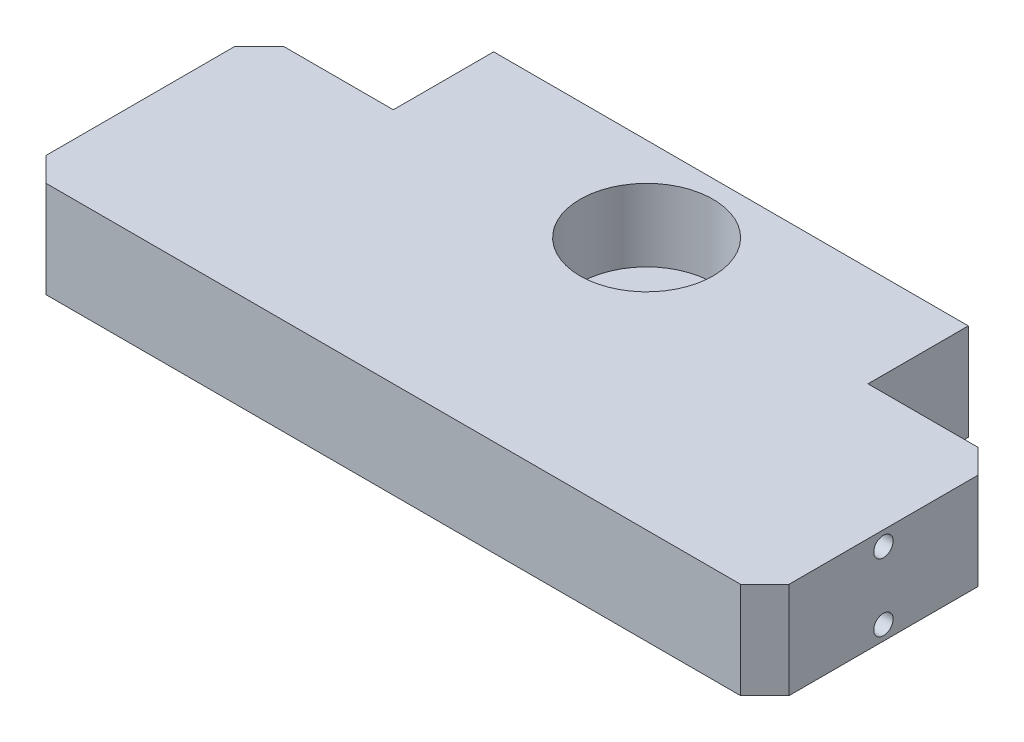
from build123d import *

# Parameters (mm, degrees)
SKETCH1_W                             = 195.58
SKETCH1_H                             = 88.9
EXTRUDE1_DEPTH                        = 25.4
SKETCH2_R                             = 17.5006
CUT_EXTRUDE1_DEPTH                    = 19.05
SKETCH3_R                             = 4.953
CUT_EXTRUDE2_DEPTH                    = 217.332860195
SKETCH4_W                             = 35.306
SKETCH4_H                             = 26.416
CUT_EXTRUDE3_DEPTH                    = 217.332860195
F_1_4_20_TAPPED_HOLE1_D               = 5.1054
F_1_4_20_TAPPED_HOLE1_DEPTH           = 19.05
F_1_4_20_TAPPED_HOLE1_TIP             = 1.533816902
F_1_4_20_TAPPED_HOLE1_ON_FACE_2_D     = 5.1054
F_1_4_20_TAPPED_HOLE1_ON_FACE_2_DEPTH = 19.05
F_1_4_20_TAPPED_HOLE1_ON_FACE_2_TIP   = 1.533816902
F_1_4_20_TAPPED_HOLE2_D               = 5.1054
F_1_4_20_TAPPED_HOLE2_DEPTH           = 19.05
F_1_4_20_TAPPED_HOLE2_TIP             = 1.533816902
CHAMFER1_SIZE                         = 6.35


with BuildPart() as part:
    # Sketch1 → Extrude1 (new body)
    with BuildSketch(Plane(origin=(0, 0, 0), x_dir=(1, 0, 0), z_dir=(0, 1, 0))):
        with Locations((97.79, 44.45)):
            Rectangle(SKETCH1_W, SKETCH1_H)
    extrude(amount=EXTRUDE1_DEPTH)

    # Sketch2 → Cut-Extrude1 (cut)
    with BuildSketch(Plane(origin=(0, 25.4, 0), x_dir=(-1, 0, 0), z_dir=(0, 1, 0))):
        with Locations(Location((-97.79, -66.675, 0), (0, 0, 90))):
            Circle(SKETCH2_R)
    extrude(amount=-CUT_EXTRUDE1_DEPTH, mode=Mode.SUBTRACT)

    # Sketch3 → Cut-Extrude2 (cut, through all)
    with BuildSketch(Plane.XZ):
        with Locations(Location((97.79, -66.675, 0), (0, 0, 270))):
            Circle(SKETCH3_R)
    extrude(amount=-CUT_EXTRUDE2_DEPTH, mode=Mode.SUBTRACT)

    # Sketch4 → Cut-Extrude3 (cut, through all)
    with BuildSketch(Plane.XZ):
        with Locations((17.653, -75.692)):
            Rectangle(SKETCH4_W, SKETCH4_H)
        with Locations((177.927, -75.692)):
            Rectangle(SKETCH4_W, SKETCH4_H)
    extrude(amount=-CUT_EXTRUDE3_DEPTH, mode=Mode.SUBTRACT)

    # 1_4-20 Tapped Hole1
    with Locations(Plane(origin=(195.58, 3.81, -31.242), x_dir=(0, 0, 1), z_dir=(1, 0, 0))):
        with Locations((0, 0), (0, -17.78)):
            Hole(F_1_4_20_TAPPED_HOLE1_D / 2, depth=F_1_4_20_TAPPED_HOLE1_DEPTH)
            with Locations((0, 0, -(F_1_4_20_TAPPED_HOLE1_DEPTH + F_1_4_20_TAPPED_HOLE1_TIP / 2))):  # 118° drill point
                Cone(0, F_1_4_20_TAPPED_HOLE1_D / 2, F_1_4_20_TAPPED_HOLE1_TIP, mode=Mode.SUBTRACT)

    # 1_4-20 Tapped Hole1 on face 2
    with Locations(Plane(origin=(222.35146903, 0, -45.157919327), x_dir=(0, 0, 1), z_dir=(1, 0, 0))):
        with Locations((0, 0)):
            Hole(F_1_4_20_TAPPED_HOLE1_ON_FACE_2_D / 2, depth=F_1_4_20_TAPPED_HOLE1_ON_FACE_2_DEPTH)
            with Locations((0, 0, -(F_1_4_20_TAPPED_HOLE1_ON_FACE_2_DEPTH + F_1_4_20_TAPPED_HOLE1_ON_FACE_2_TIP / 2))):  # 118° drill point
                Cone(0, F_1_4_20_TAPPED_HOLE1_ON_FACE_2_D / 2, F_1_4_20_TAPPED_HOLE1_ON_FACE_2_TIP, mode=Mode.SUBTRACT)

    # 1_4-20 Tapped Hole2
    with Locations(Plane(origin=(0, 21.59, -31.242), x_dir=(0, 0, -1), z_dir=(-1, 0, 0))):
        with Locations((0, 0), (0, 17.78)):
            Hole(F_1_4_20_TAPPED_HOLE2_D / 2, depth=F_1_4_20_TAPPED_HOLE2_DEPTH)
            with Locations((0, 0, -(F_1_4_20_TAPPED_HOLE2_DEPTH + F_1_4_20_TAPPED_HOLE2_TIP / 2))):  # 118° drill point
                Cone(0, F_1_4_20_TAPPED_HOLE2_D / 2, F_1_4_20_TAPPED_HOLE2_TIP, mode=Mode.SUBTRACT)

    # Chamfer1
    chamfer1_edges = [part.edges().sort_by_distance(p)[0] for p in [
        (0, 12.7, -62.484),
        (195.58, 12.7, -62.484),
        (195.58, 12.7, 0),
        (0, 12.7, 0),
    ]]
    chamfer(chamfer1_edges, length=CHAMFER1_SIZE)


solid = part.part
